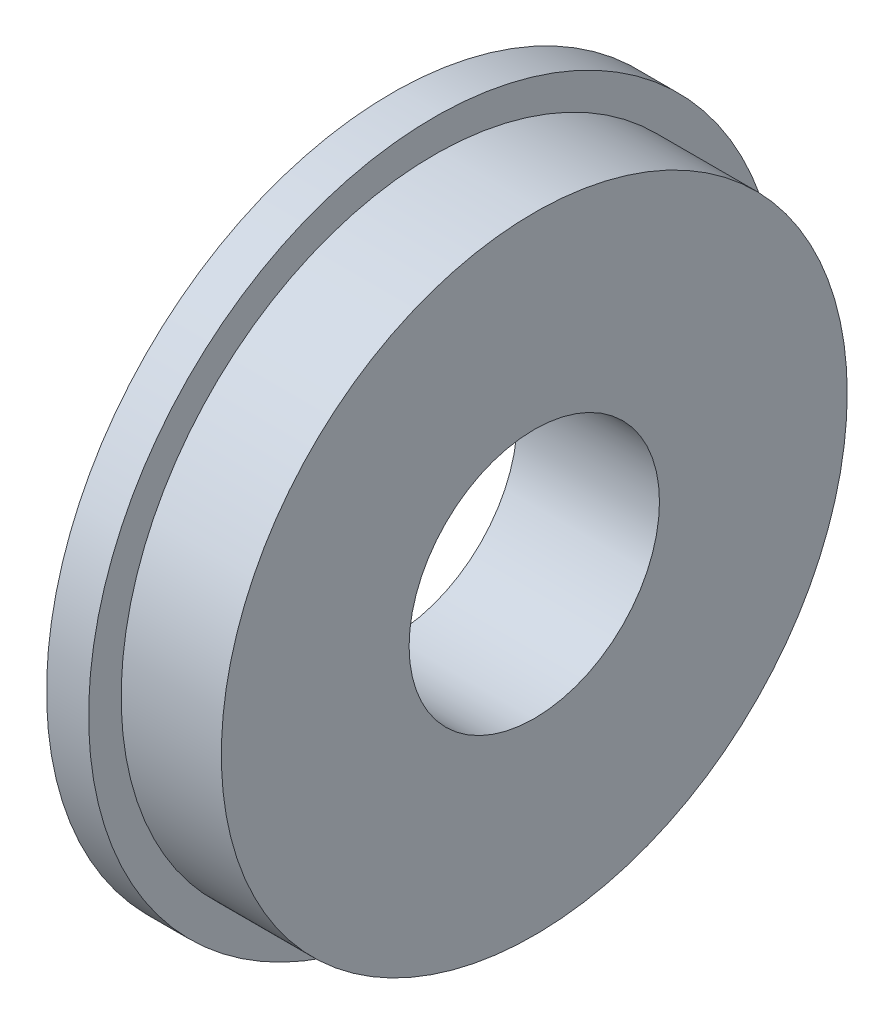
ISO-10303-21;
HEADER;
FILE_DESCRIPTION(('STEP AP214'),'2;1');
FILE_NAME('part.step','',(''),(''),'','','');
FILE_SCHEMA(('AUTOMOTIVE_DESIGN { 1 0 10303 214 1 1 1 1 }'));
ENDSEC;
DATA;
#1=APPLICATION_CONTEXT('core data for automotive mechanical design processes');
#2=APPLICATION_PROTOCOL_DEFINITION('international standard','automotive_design',2000,#1);
#3=PRODUCT_CONTEXT('',#1,'mechanical');
#4=PRODUCT('Part','Part','',(#3));
#5=PRODUCT_RELATED_PRODUCT_CATEGORY('part','',(#4));
#6=PRODUCT_DEFINITION_FORMATION('','',#4);
#7=PRODUCT_DEFINITION_CONTEXT('part definition',#1,'design');
#8=PRODUCT_DEFINITION('design','',#6,#7);
#9=PRODUCT_DEFINITION_SHAPE('','',#8);
#10=(LENGTH_UNIT() NAMED_UNIT(*) SI_UNIT(.MILLI.,.METRE.));
#11=(NAMED_UNIT(*) PLANE_ANGLE_UNIT() SI_UNIT($,.RADIAN.));
#12=(NAMED_UNIT(*) SI_UNIT($,.STERADIAN.) SOLID_ANGLE_UNIT());
#13=UNCERTAINTY_MEASURE_WITH_UNIT(LENGTH_MEASURE(1.E-05),#10,'distance_accuracy_value','');
#14=(GEOMETRIC_REPRESENTATION_CONTEXT(3) GLOBAL_UNCERTAINTY_ASSIGNED_CONTEXT((#13)) GLOBAL_UNIT_ASSIGNED_CONTEXT((#10,
#11,#12)) REPRESENTATION_CONTEXT('',''));
#15=CARTESIAN_POINT('',(0.,0.,0.));
#16=DIRECTION('',(0.,0.,1.));
#17=DIRECTION('',(1.,0.,0.));
#18=AXIS2_PLACEMENT_3D('',#15,#16,#17);
#19=CARTESIAN_POINT('',(0.,0.,0.));
#20=DIRECTION('',(1.,0.,0.));
#21=DIRECTION('',(0.,0.,-1.));
#22=AXIS2_PLACEMENT_3D('',#19,#20,#21);
#23=CYLINDRICAL_SURFACE('',#22,7.9375);
#24=CARTESIAN_POINT('',(-2.54,0.,0.));
#25=DIRECTION('',(1.,0.,0.));
#26=DIRECTION('',(0.,0.,-1.));
#27=AXIS2_PLACEMENT_3D('',#24,#25,#26);
#28=CIRCLE('',#27,7.9375);
#29=CARTESIAN_POINT('',(-2.54,0.,-7.9375));
#30=VERTEX_POINT('',#29);
#31=EDGE_CURVE('E48',#30,#30,#28,.T.);
#32=ORIENTED_EDGE('',*,*,#31,.T.);
#33=EDGE_LOOP('',(#32));
#34=FACE_BOUND('',#33,.T.);
#35=CARTESIAN_POINT('',(0.,0.,0.));
#36=DIRECTION('',(1.,0.,0.));
#37=DIRECTION('',(0.,0.,-1.));
#38=AXIS2_PLACEMENT_3D('',#35,#36,#37);
#39=CIRCLE('',#38,7.9375);
#40=CARTESIAN_POINT('',(0.,0.,-7.9375));
#41=VERTEX_POINT('',#40);
#42=EDGE_CURVE('E10',#41,#41,#39,.T.);
#43=ORIENTED_EDGE('',*,*,#42,.F.);
#44=EDGE_LOOP('',(#43));
#45=FACE_BOUND('',#44,.T.);
#46=ADVANCED_FACE('F26',(#34,#45),#23,.T.);
#47=CARTESIAN_POINT('',(0.,0.,-7.9375));
#48=DIRECTION('',(1.,0.,0.));
#49=DIRECTION('',(0.,0.,-1.));
#50=AXIS2_PLACEMENT_3D('',#47,#48,#49);
#51=PLANE('',#50);
#52=ORIENTED_EDGE('',*,*,#42,.T.);
#53=EDGE_LOOP('',(#52));
#54=FACE_BOUND('',#53,.T.);
#55=CARTESIAN_POINT('',(0.,0.,0.));
#56=DIRECTION('',(1.,0.,0.));
#57=DIRECTION('',(0.,0.,-1.));
#58=AXIS2_PLACEMENT_3D('',#55,#56,#57);
#59=CIRCLE('',#58,3.175);
#60=CARTESIAN_POINT('',(0.,0.,-3.175));
#61=VERTEX_POINT('',#60);
#62=EDGE_CURVE('E32',#61,#61,#59,.T.);
#63=ORIENTED_EDGE('',*,*,#62,.F.);
#64=EDGE_LOOP('',(#63));
#65=FACE_BOUND('',#64,.T.);
#66=ADVANCED_FACE('F66',(#54,#65),#51,.T.);
#67=CARTESIAN_POINT('',(0.,0.,0.));
#68=DIRECTION('',(1.,0.,0.));
#69=DIRECTION('',(0.,0.,-1.));
#70=AXIS2_PLACEMENT_3D('',#67,#68,#69);
#71=CYLINDRICAL_SURFACE('',#70,3.175);
#72=ORIENTED_EDGE('',*,*,#62,.T.);
#73=EDGE_LOOP('',(#72));
#74=FACE_BOUND('',#73,.T.);
#75=CARTESIAN_POINT('',(-3.6068,0.,0.));
#76=DIRECTION('',(1.,0.,0.));
#77=DIRECTION('',(0.,0.,-1.));
#78=AXIS2_PLACEMENT_3D('',#75,#76,#77);
#79=CIRCLE('',#78,3.175);
#80=CARTESIAN_POINT('',(-3.6068,0.,-3.175));
#81=VERTEX_POINT('',#80);
#82=EDGE_CURVE('E36',#81,#81,#79,.T.);
#83=ORIENTED_EDGE('',*,*,#82,.F.);
#84=EDGE_LOOP('',(#83));
#85=FACE_BOUND('',#84,.T.);
#86=ADVANCED_FACE('F70',(#74,#85),#71,.F.);
#87=CARTESIAN_POINT('',(-3.6068,0.,-3.175));
#88=DIRECTION('',(-1.,0.,0.));
#89=DIRECTION('',(0.,0.,1.));
#90=AXIS2_PLACEMENT_3D('',#87,#88,#89);
#91=PLANE('',#90);
#92=ORIENTED_EDGE('',*,*,#82,.T.);
#93=EDGE_LOOP('',(#92));
#94=FACE_BOUND('',#93,.T.);
#95=CARTESIAN_POINT('',(-3.6068,0.,0.));
#96=DIRECTION('',(1.,0.,0.));
#97=DIRECTION('',(0.,0.,-1.));
#98=AXIS2_PLACEMENT_3D('',#95,#96,#97);
#99=CIRCLE('',#98,8.763);
#100=CARTESIAN_POINT('',(-3.6068,0.,-8.763));
#101=VERTEX_POINT('',#100);
#102=EDGE_CURVE('E40',#101,#101,#99,.T.);
#103=ORIENTED_EDGE('',*,*,#102,.F.);
#104=EDGE_LOOP('',(#103));
#105=FACE_BOUND('',#104,.T.);
#106=ADVANCED_FACE('F62',(#94,#105),#91,.T.);
#107=CARTESIAN_POINT('',(0.,0.,0.));
#108=DIRECTION('',(1.,0.,0.));
#109=DIRECTION('',(0.,0.,-1.));
#110=AXIS2_PLACEMENT_3D('',#107,#108,#109);
#111=CYLINDRICAL_SURFACE('',#110,8.763);
#112=ORIENTED_EDGE('',*,*,#102,.T.);
#113=EDGE_LOOP('',(#112));
#114=FACE_BOUND('',#113,.T.);
#115=CARTESIAN_POINT('',(-2.54,0.,0.));
#116=DIRECTION('',(1.,0.,0.));
#117=DIRECTION('',(0.,0.,-1.));
#118=AXIS2_PLACEMENT_3D('',#115,#116,#117);
#119=CIRCLE('',#118,8.763);
#120=CARTESIAN_POINT('',(-2.54,0.,-8.763));
#121=VERTEX_POINT('',#120);
#122=EDGE_CURVE('E45',#121,#121,#119,.T.);
#123=ORIENTED_EDGE('',*,*,#122,.F.);
#124=EDGE_LOOP('',(#123));
#125=FACE_BOUND('',#124,.T.);
#126=ADVANCED_FACE('F56',(#114,#125),#111,.T.);
#127=CARTESIAN_POINT('',(-2.54,0.,-8.763));
#128=DIRECTION('',(1.,0.,0.));
#129=DIRECTION('',(0.,0.,-1.));
#130=AXIS2_PLACEMENT_3D('',#127,#128,#129);
#131=PLANE('',#130);
#132=ORIENTED_EDGE('',*,*,#122,.T.);
#133=EDGE_LOOP('',(#132));
#134=FACE_BOUND('',#133,.T.);
#135=ORIENTED_EDGE('',*,*,#31,.F.);
#136=EDGE_LOOP('',(#135));
#137=FACE_BOUND('',#136,.T.);
#138=ADVANCED_FACE('F54',(#134,#137),#131,.T.);
#139=CLOSED_SHELL('',(#46,#66,#86,#106,#126,#138));
#140=MANIFOLD_SOLID_BREP('B2',#139);
#141=ADVANCED_BREP_SHAPE_REPRESENTATION('',(#18,#140),#14);
#142=SHAPE_DEFINITION_REPRESENTATION(#9,#141);
ENDSEC;
END-ISO-10303-21;
